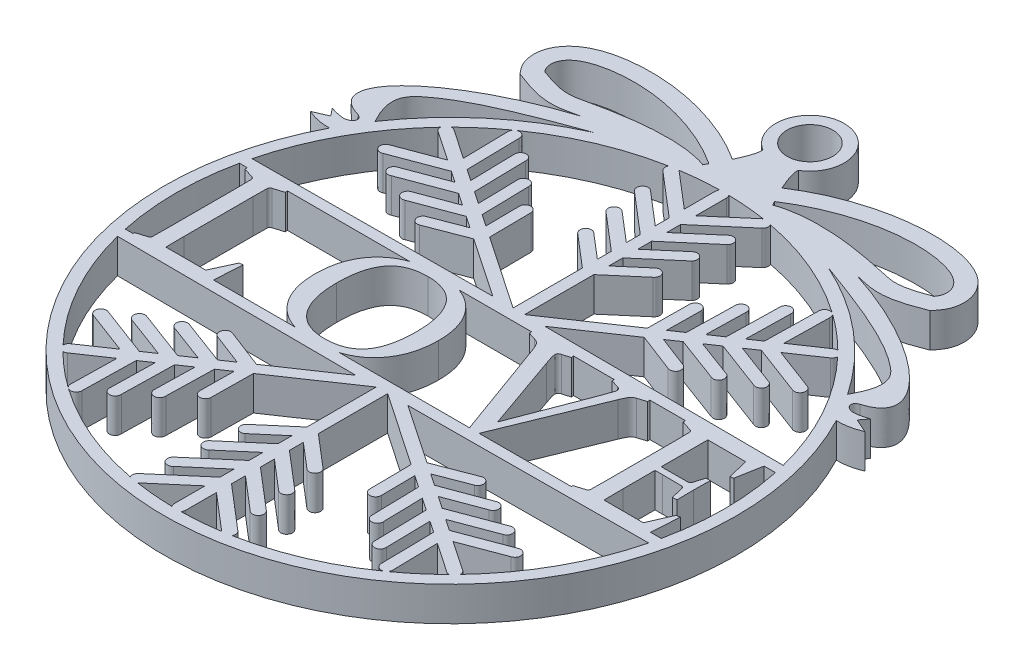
from build123d import *

# Parameters (mm, degrees)
BOSS_EXTRUDE2_DEPTH   = 1.5
BOSS_EXTRUDE2_2_DEPTH = 1.5
SKETCH2_R             = 2
BOSS_EXTRUDE4_DEPTH   = 1.5
SKETCH8_R             = 25.05
SKETCH8_R_2           = 24
EXTRUDE_THIN2_DEPTH   = 3
BOSS_EXTRUDE5_DEPTH   = 3


with BuildPart() as part:
    # Sketch3 → Boss-Extrude2 (new, symmetric)
    with BuildSketch(Plane(origin=(0, 0, 0), x_dir=(1, 0, 0), z_dir=(0, 1, 0))):
        with BuildLine():
            Line((-9.95053993, -12.407957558), (-11.02013319, -13.133363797))
            Line((-11.02013319, -13.133363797), (-11.111956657, -17.716070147))
            ThreePointArc((-11.111956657, -17.716070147), (-11.616135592, -18.254960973), (-12.1078934, -17.704711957))
            Line((-12.1078934, -17.704711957), (-12.030021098, -13.818277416))
            Line((-12.030021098, -13.818277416), (-13.023355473, -14.491964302))
            Line((-13.023355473, -14.491964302), (-13.11065071, -19.136355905))
            ThreePointArc((-13.11065071, -19.136355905), (-13.616817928, -19.663735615), (-14.10818269, -19.122537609))
            Line((-14.10818269, -19.122537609), (-14.034030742, -15.177411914))
            Line((-14.034030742, -15.177411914), (-16.622720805, -16.933081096))
            ThreePointArc((-16.622720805, -16.933081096), (-17.317176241, -16.799920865), (-17.184016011, -16.105465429))
            Line((-17.184016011, -16.105465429), (-14.595325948, -14.349796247))
            Line((-14.595325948, -14.349796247), (-18.2880658, -12.959405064))
            ThreePointArc((-18.2880658, -12.959405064), (-18.609124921, -12.302704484), (-17.931921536, -12.0275133))
            Line((-17.931921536, -12.0275133), (-13.584650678, -13.664348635))
            Line((-13.584650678, -13.664348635), (-12.591316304, -12.990661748))
            Line((-12.591316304, -12.990661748), (-16.230903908, -11.625436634))
            ThreePointArc((-16.230903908, -11.625436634), (-16.560226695, -10.965022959), (-15.873064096, -10.695936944))
            Line((-15.873064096, -10.695936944), (-11.581428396, -12.30574813))
            Line((-11.581428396, -12.30574813), (-10.511835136, -11.580341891))
            Line((-10.511835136, -11.580341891), (-13.755885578, -10.372158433))
            ThreePointArc((-13.755885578, -10.372158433), (-14.092353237, -9.710538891), (-13.399885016, -9.443258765))
            Line((-13.399885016, -9.443258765), (-9.50151089, -10.895132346))
            Line((-9.50151089, -10.895132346), (-8.474348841, -10.198503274))
            Line((-8.474348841, -10.198503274), (-11.245208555, -9.132044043))
            ThreePointArc((-11.245208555, -9.132044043), (-11.533826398, -8.486529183), (-10.888311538, -8.19791134))
            Line((-10.888311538, -8.19791134), (-7.466442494, -9.514933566))
            Line((-7.466442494, -9.514933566), (-2.283761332, -6))
            Line((-2.283761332, -6), (-23.405560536, -5.888541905))
            Line((-23.405560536, -5.888541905), (-23.611336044, -5))
            Line((-23.611336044, -5), (23.611336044, -5))
            Line((23.611336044, -5), (23.405560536, -5.888541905))
            Line((23.405560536, -5.888541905), (2.283761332, -6))
            Line((2.283761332, -6), (7.466442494, -9.514933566))
            Line((7.466442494, -9.514933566), (10.888311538, -8.19791134))
            ThreePointArc((10.888311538, -8.19791134), (11.533826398, -8.486529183), (11.245208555, -9.132044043))
            Line((11.245208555, -9.132044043), (8.474348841, -10.198503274))
            Line((8.474348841, -10.198503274), (9.50151089, -10.895132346))
            Line((9.50151089, -10.895132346), (13.399885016, -9.443258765))
            ThreePointArc((13.399885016, -9.443258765), (14.092353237, -9.710538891), (13.755885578, -10.372158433))
            Line((13.755885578, -10.372158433), (10.511835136, -11.580341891))
            Line((10.511835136, -11.580341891), (11.581428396, -12.30574813))
            Line((11.581428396, -12.30574813), (15.873064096, -10.695936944))
            ThreePointArc((15.873064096, -10.695936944), (16.560226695, -10.965022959), (16.230903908, -11.625436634))
            Line((16.230903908, -11.625436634), (12.591316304, -12.990661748))
            Line((12.591316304, -12.990661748), (13.584650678, -13.664348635))
            Line((13.584650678, -13.664348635), (17.931921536, -12.0275133))
            ThreePointArc((17.931921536, -12.0275133), (18.609124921, -12.302704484), (18.2880658, -12.959405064))
            Line((18.2880658, -12.959405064), (14.595325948, -14.349796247))
            Line((14.595325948, -14.349796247), (17.184016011, -16.105465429))
            ThreePointArc((17.184016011, -16.105465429), (17.317176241, -16.799920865), (16.622720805, -16.933081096))
            Line((16.622720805, -16.933081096), (14.034030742, -15.177411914))
            Line((14.034030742, -15.177411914), (14.10818269, -19.122537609))
            ThreePointArc((14.10818269, -19.122537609), (13.616817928, -19.663735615), (13.11065071, -19.136355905))
            Line((13.11065071, -19.136355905), (13.023355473, -14.491964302))
            Line((13.023355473, -14.491964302), (12.030021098, -13.818277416))
            Line((12.030021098, -13.818277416), (12.1078934, -17.704711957))
            ThreePointArc((12.1078934, -17.704711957), (11.616135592, -18.254960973), (11.111956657, -17.716070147))
            Line((11.111956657, -17.716070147), (11.02013319, -13.133363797))
            Line((11.02013319, -13.133363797), (9.95053993, -12.407957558))
            Line((9.95053993, -12.407957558), (10.028008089, -15.868820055))
            ThreePointArc((10.028008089, -15.868820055), (9.537772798, -16.426153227), (9.03330914, -15.881665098))
            Line((9.03330914, -15.881665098), (8.940215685, -11.722748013))
            Line((8.940215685, -11.722748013), (7.913053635, -11.026118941))
            Line((7.913053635, -11.026118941), (7.947162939, -13.994929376))
            ThreePointArc((7.947162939, -13.994929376), (7.454190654, -14.501849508), (6.947270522, -14.008877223))
            Line((6.947270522, -14.008877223), (6.905147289, -10.342549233))
            Line((6.905147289, -10.342549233), (0.502167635, -6))
            Line((0.502167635, -6), (0.502167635, -12.0664664))
            Line((0.502167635, -12.0664664), (3.297599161, -14.456985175))
            ThreePointArc((3.297599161, -14.456985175), (3.413784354, -15.150742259), (2.722066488, -15.278508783))
            Line((2.722066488, -15.278508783), (0.502167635, -13.380157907))
            Line((0.502167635, -13.380157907), (0.502167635, -14.602209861))
            Line((0.502167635, -14.602209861), (3.764126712, -17.39168059))
            ThreePointArc((3.764126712, -17.39168059), (3.749772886, -18.095076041), (3.046236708, -18.092240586))
            Line((3.046236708, -18.092240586), (0.502167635, -15.916674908))
            Line((0.502167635, -15.916674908), (0.502167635, -17.138726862))
            Line((0.502167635, -17.138726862), (4.053708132, -20.175833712))
            ThreePointArc((4.053708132, -20.175833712), (4.084623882, -20.90950726), (3.350619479, -20.88782325))
            Line((3.350619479, -20.88782325), (0.502167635, -18.451964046))
            Line((0.502167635, -18.451964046), (0.502167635, -19.674016))
            Line((0.502167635, -19.674016), (4.347506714, -22.962365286))
            ThreePointArc((4.347506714, -22.962365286), (4.402725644, -23.669585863), (3.695505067, -23.724804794))
            Line((3.695505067, -23.724804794), (0.502167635, -20.994016))
            Line((0.502167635, -20.994016), (0.502167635, -23.688425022))
            ThreePointArc((0.502167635, -23.688425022), (0, -24.190592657), (-0.502167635, -23.688425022))
            Line((-0.502167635, -23.688425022), (-0.502167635, -20.994016))
            Line((-0.502167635, -20.994016), (-3.695505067, -23.724804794))
            ThreePointArc((-3.695505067, -23.724804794), (-4.402725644, -23.669585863), (-4.347506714, -22.962365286))
            Line((-4.347506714, -22.962365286), (-0.502167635, -19.674016))
            Line((-0.502167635, -19.674016), (-0.502167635, -18.451964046))
            Line((-0.502167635, -18.451964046), (-3.350619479, -20.88782325))
            ThreePointArc((-3.350619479, -20.88782325), (-4.084623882, -20.90950726), (-4.053708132, -20.175833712))
            Line((-4.053708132, -20.175833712), (-0.502167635, -17.138726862))
            Line((-0.502167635, -17.138726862), (-0.502167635, -15.916674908))
            Line((-0.502167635, -15.916674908), (-3.046236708, -18.092240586))
            ThreePointArc((-3.046236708, -18.092240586), (-3.749772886, -18.095076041), (-3.764126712, -17.39168059))
            Line((-3.764126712, -17.39168059), (-0.502167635, -14.602209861))
            Line((-0.502167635, -14.602209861), (-0.502167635, -13.380157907))
            Line((-0.502167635, -13.380157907), (-2.722066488, -15.278508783))
            ThreePointArc((-2.722066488, -15.278508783), (-3.413784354, -15.150742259), (-3.297599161, -14.456985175))
            Line((-3.297599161, -14.456985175), (-0.502167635, -12.0664664))
            Line((-0.502167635, -12.0664664), (-0.502167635, -6))
            Line((-0.502167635, -6), (-6.905147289, -10.342549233))
            Line((-6.905147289, -10.342549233), (-6.947270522, -14.008877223))
            ThreePointArc((-6.947270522, -14.008877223), (-7.454190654, -14.501849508), (-7.947162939, -13.994929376))
            Line((-7.947162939, -13.994929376), (-7.913053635, -11.026118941))
            Line((-7.913053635, -11.026118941), (-8.940215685, -11.722748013))
            Line((-8.940215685, -11.722748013), (-9.03330914, -15.881665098))
            ThreePointArc((-9.03330914, -15.881665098), (-9.537772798, -16.426153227), (-10.028008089, -15.868820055))
            Line((-10.028008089, -15.868820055), (-9.95053993, -12.407957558))
        make_face()
    extrude(amount=BOSS_EXTRUDE2_DEPTH, both=True)



with BuildPart() as body_2:
    # Sketch3 → Boss-Extrude2 2 (new, symmetric)
    with BuildSketch(Plane(origin=(0, 0, 0), x_dir=(1, 0, 0), z_dir=(0, 1, 0))):
        with BuildLine():
            Line((9.95053993, 12.407957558), (11.02013319, 13.133363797))
            Line((11.02013319, 13.133363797), (11.111956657, 17.716070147))
            ThreePointArc((11.111956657, 17.716070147), (11.616135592, 18.254960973), (12.1078934, 17.704711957))
            Line((12.1078934, 17.704711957), (12.030021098, 13.818277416))
            Line((12.030021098, 13.818277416), (13.023355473, 14.491964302))
            Line((13.023355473, 14.491964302), (13.11065071, 19.136355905))
            ThreePointArc((13.11065071, 19.136355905), (13.616817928, 19.663735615), (14.10818269, 19.122537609))
            Line((14.10818269, 19.122537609), (14.034030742, 15.177411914))
            Line((14.034030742, 15.177411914), (16.622720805, 16.933081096))
            ThreePointArc((16.622720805, 16.933081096), (17.317176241, 16.799920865), (17.184016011, 16.105465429))
            Line((17.184016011, 16.105465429), (14.595325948, 14.349796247))
            Line((14.595325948, 14.349796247), (18.2880658, 12.959405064))
            ThreePointArc((18.2880658, 12.959405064), (18.609124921, 12.302704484), (17.931921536, 12.0275133))
            Line((17.931921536, 12.0275133), (13.584650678, 13.664348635))
            Line((13.584650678, 13.664348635), (12.591316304, 12.990661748))
            Line((12.591316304, 12.990661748), (16.230903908, 11.625436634))
            ThreePointArc((16.230903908, 11.625436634), (16.560226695, 10.965022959), (15.873064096, 10.695936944))
            Line((15.873064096, 10.695936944), (11.581428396, 12.30574813))
            Line((11.581428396, 12.30574813), (10.511835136, 11.580341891))
            Line((10.511835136, 11.580341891), (13.755885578, 10.372158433))
            ThreePointArc((13.755885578, 10.372158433), (14.092353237, 9.710538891), (13.399885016, 9.443258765))
            Line((13.399885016, 9.443258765), (9.50151089, 10.895132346))
            Line((9.50151089, 10.895132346), (8.474348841, 10.198503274))
            Line((8.474348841, 10.198503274), (11.245208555, 9.132044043))
            ThreePointArc((11.245208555, 9.132044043), (11.533826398, 8.486529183), (10.888311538, 8.19791134))
            Line((10.888311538, 8.19791134), (7.466442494, 9.514933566))
            Line((7.466442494, 9.514933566), (2.283761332, 6))
            Line((2.283761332, 6), (23.405560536, 5.888541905))
            Line((23.405560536, 5.888541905), (23.611336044, 5))
            Line((23.611336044, 5), (-23.611336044, 5))
            Line((-23.611336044, 5), (-23.405560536, 5.888541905))
            Line((-23.405560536, 5.888541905), (-2.283761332, 6))
            Line((-2.283761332, 6), (-7.466442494, 9.514933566))
            Line((-7.466442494, 9.514933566), (-10.888311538, 8.19791134))
            ThreePointArc((-10.888311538, 8.19791134), (-11.533826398, 8.486529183), (-11.245208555, 9.132044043))
            Line((-11.245208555, 9.132044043), (-8.474348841, 10.198503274))
            Line((-8.474348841, 10.198503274), (-9.50151089, 10.895132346))
            Line((-9.50151089, 10.895132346), (-13.399885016, 9.443258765))
            ThreePointArc((-13.399885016, 9.443258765), (-14.092353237, 9.710538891), (-13.755885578, 10.372158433))
            Line((-13.755885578, 10.372158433), (-10.511835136, 11.580341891))
            Line((-10.511835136, 11.580341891), (-11.581428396, 12.30574813))
            Line((-11.581428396, 12.30574813), (-15.873064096, 10.695936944))
            ThreePointArc((-15.873064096, 10.695936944), (-16.560226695, 10.965022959), (-16.230903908, 11.625436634))
            Line((-16.230903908, 11.625436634), (-12.591316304, 12.990661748))
            Line((-12.591316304, 12.990661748), (-13.584650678, 13.664348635))
            Line((-13.584650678, 13.664348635), (-17.931921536, 12.0275133))
            ThreePointArc((-17.931921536, 12.0275133), (-18.609124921, 12.302704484), (-18.2880658, 12.959405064))
            Line((-18.2880658, 12.959405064), (-14.595325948, 14.349796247))
            Line((-14.595325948, 14.349796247), (-17.184016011, 16.105465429))
            ThreePointArc((-17.184016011, 16.105465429), (-17.317176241, 16.799920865), (-16.622720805, 16.933081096))
            Line((-16.622720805, 16.933081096), (-14.034030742, 15.177411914))
            Line((-14.034030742, 15.177411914), (-14.10818269, 19.122537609))
            ThreePointArc((-14.10818269, 19.122537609), (-13.616817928, 19.663735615), (-13.11065071, 19.136355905))
            Line((-13.11065071, 19.136355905), (-13.023355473, 14.491964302))
            Line((-13.023355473, 14.491964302), (-12.030021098, 13.818277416))
            Line((-12.030021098, 13.818277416), (-12.1078934, 17.704711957))
            ThreePointArc((-12.1078934, 17.704711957), (-11.616135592, 18.254960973), (-11.111956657, 17.716070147))
            Line((-11.111956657, 17.716070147), (-11.02013319, 13.133363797))
            Line((-11.02013319, 13.133363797), (-9.95053993, 12.407957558))
            Line((-9.95053993, 12.407957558), (-10.028008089, 15.868820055))
            ThreePointArc((-10.028008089, 15.868820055), (-9.537772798, 16.426153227), (-9.03330914, 15.881665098))
            Line((-9.03330914, 15.881665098), (-8.940215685, 11.722748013))
            Line((-8.940215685, 11.722748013), (-7.913053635, 11.026118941))
            Line((-7.913053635, 11.026118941), (-7.947162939, 13.994929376))
            ThreePointArc((-7.947162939, 13.994929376), (-7.454190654, 14.501849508), (-6.947270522, 14.008877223))
            Line((-6.947270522, 14.008877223), (-6.905147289, 10.342549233))
            Line((-6.905147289, 10.342549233), (-0.502167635, 6))
            Line((-0.502167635, 6), (-0.502167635, 12.0664664))
            Line((-0.502167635, 12.0664664), (-3.297599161, 14.456985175))
            ThreePointArc((-3.297599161, 14.456985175), (-3.413784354, 15.150742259), (-2.722066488, 15.278508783))
            Line((-2.722066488, 15.278508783), (-0.502167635, 13.380157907))
            Line((-0.502167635, 13.380157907), (-0.502167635, 14.602209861))
            Line((-0.502167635, 14.602209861), (-3.764126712, 17.39168059))
            ThreePointArc((-3.764126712, 17.39168059), (-3.749772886, 18.095076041), (-3.046236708, 18.092240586))
            Line((-3.046236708, 18.092240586), (-0.502167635, 15.916674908))
            Line((-0.502167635, 15.916674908), (-0.502167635, 17.138726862))
            Line((-0.502167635, 17.138726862), (-4.053708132, 20.175833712))
            ThreePointArc((-4.053708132, 20.175833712), (-4.084623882, 20.90950726), (-3.350619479, 20.88782325))
            Line((-3.350619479, 20.88782325), (-0.502167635, 18.451964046))
            Line((-0.502167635, 18.451964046), (-0.502167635, 19.674016))
            Line((-0.502167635, 19.674016), (-4.347506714, 22.962365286))
            ThreePointArc((-4.347506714, 22.962365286), (-4.402725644, 23.669585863), (-3.695505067, 23.724804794))
            Line((-3.695505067, 23.724804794), (-0.502167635, 20.994016))
            Line((-0.502167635, 20.994016), (-0.502167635, 23.688425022))
            ThreePointArc((-0.502167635, 23.688425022), (0, 24.190592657), (0.502167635, 23.688425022))
            Line((0.502167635, 23.688425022), (0.502167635, 20.994016))
            Line((0.502167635, 20.994016), (3.695505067, 23.724804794))
            ThreePointArc((3.695505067, 23.724804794), (4.402725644, 23.669585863), (4.347506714, 22.962365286))
            Line((4.347506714, 22.962365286), (0.502167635, 19.674016))
            Line((0.502167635, 19.674016), (0.502167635, 18.451964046))
            Line((0.502167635, 18.451964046), (3.350619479, 20.88782325))
            ThreePointArc((3.350619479, 20.88782325), (4.084623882, 20.90950726), (4.053708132, 20.175833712))
            Line((4.053708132, 20.175833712), (0.502167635, 17.138726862))
            Line((0.502167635, 17.138726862), (0.502167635, 15.916674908))
            Line((0.502167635, 15.916674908), (3.046236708, 18.092240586))
            ThreePointArc((3.046236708, 18.092240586), (3.749772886, 18.095076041), (3.764126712, 17.39168059))
            Line((3.764126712, 17.39168059), (0.502167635, 14.602209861))
            Line((0.502167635, 14.602209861), (0.502167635, 13.380157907))
            Line((0.502167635, 13.380157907), (2.722066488, 15.278508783))
            ThreePointArc((2.722066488, 15.278508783), (3.413784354, 15.150742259), (3.297599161, 14.456985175))
            Line((3.297599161, 14.456985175), (0.502167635, 12.0664664))
            Line((0.502167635, 12.0664664), (0.502167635, 6))
            Line((0.502167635, 6), (6.905147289, 10.342549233))
            Line((6.905147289, 10.342549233), (6.947270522, 14.008877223))
            ThreePointArc((6.947270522, 14.008877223), (7.454190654, 14.501849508), (7.947162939, 13.994929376))
            Line((7.947162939, 13.994929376), (7.913053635, 11.026118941))
            Line((7.913053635, 11.026118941), (8.940215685, 11.722748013))
            Line((8.940215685, 11.722748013), (9.03330914, 15.881665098))
            ThreePointArc((9.03330914, 15.881665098), (9.537772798, 16.426153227), (10.028008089, 15.868820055))
            Line((10.028008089, 15.868820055), (9.95053993, 12.407957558))
        make_face()
    extrude(amount=BOSS_EXTRUDE2_2_DEPTH, both=True)


with BuildPart() as body_3:
    # Sketch2 → Boss-Extrude4 (new, symmetric)
    # profile 1 of 6: a face of its own
    with BuildSketch(Plane(origin=(0, 0, 0), x_dir=(1, 0, 0), z_dir=(0, 1, 0))):
        with BuildLine():
            add(Edge.make_bspline(
                [(-21.984852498, 13.889314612), (-21.425451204, 13.659442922), (-21.566848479, 13.143977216), (-22.3704381, 12.915956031), (-23.179701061, 13.088289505), (-23.581579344, 13.242077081)],
                knots=[0, 0, 0, 0, 0.635839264, 0.735839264, 1, 1, 1, 1], degree=3))
            Line((-23.581579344, 13.242077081), (-23.055113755, 12.570307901))
            Line((-23.055113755, 12.570307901), (-24.299399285, 12.027768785))
            add(Edge.make_bspline(
                [(-24.299399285, 12.027768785), (-23.200622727, 11.560958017), (-22.137413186, 11.616149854)],
                knots=[0, 0, 0, 0.622250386, 0.622250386, 0.622250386], degree=2))
            ThreePointArc((-22.137413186, 11.616149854), (-21.441447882, 12.855516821), (-20.676170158, 14.053326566))
            add(Edge.make_bspline(
                [(-20.676170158, 14.053326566), (-22.103620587, 16.601719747), (-19.889079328, 18.949917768), (-15.663458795, 20.9429823), (-9.487582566, 23.129759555)],
                knots=[0, 0, 0, 0, 0.333758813, 0.923979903, 0.923979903, 0.923979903, 0.923979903], degree=3))
            ThreePointArc((-9.487582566, 23.129759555), (-8.217191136, 23.610967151), (-6.922536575, 24.022457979))
            ThreePointArc((-6.922536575, 24.022457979), (-6.545923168, 24.127803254), (-6.167707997, 24.227244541))
            add(Edge.make_bspline(
                [(-12.107829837, 23.514528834), (-12.061764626, 23.524623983), (-11.903850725, 23.558997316), (-11.53239248, 23.637404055), (-10.918051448, 23.758275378), (-9.706802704, 23.97135513), (-8.210921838, 24.169455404), (-6.874820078, 24.233329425), (-6.328875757, 24.230827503), (-6.167707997, 24.227244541)],
                knots=[0.41766523, 0.41766523, 0.41766523, 0.41766523, 0.432883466, 0.468899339, 0.529773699, 0.590648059, 0.712396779, 0.773271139, 0.799157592, 0.799157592, 0.799157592, 0.799157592], degree=3))
            add(Edge.make_bspline(
                [(-12.107829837, 23.514528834), (-20.997302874, 20.660636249), (-26.583122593, 15.195786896), (-21.984852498, 13.889314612)],
                knots=[0.159398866, 0.159398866, 0.159398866, 0.159398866, 0.84892325, 0.84892325, 0.84892325, 0.84892325], degree=3))
        make_face()
    # profile 2 of 6: a face of its own
    with BuildSketch(Plane(origin=(0, 0, 0), x_dir=(1, 0, 0), z_dir=(0, 1, 0))):
        with BuildLine():
            add(Edge.make_bspline(
                [(-17.95998301, 24.058120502), (-17.545226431, 23.896825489), (-16.66217893, 23.559491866), (-15.607966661, 23.276253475), (-14.678757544, 23.142281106), (-13.862985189, 23.157329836), (-13.198586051, 23.269826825), (-12.728462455, 23.376064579), (-12.363448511, 23.458189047), (-12.153897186, 23.504433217), (-12.107829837, 23.514528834)],
                knots=[-0.01809554, -0.01809554, -0.01809554, -0.01809554, 0.04277882, 0.10365318, 0.16452754, 0.2254019, 0.286276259, 0.347150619, 0.402446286, 0.41766523, 0.41766523, 0.41766523, 0.41766523], degree=3))
            add(Edge.make_bspline(
                [(-12.107829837, 23.514528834), (-12.061764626, 23.524623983), (-11.903850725, 23.558997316), (-11.53239248, 23.637404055), (-10.918051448, 23.758275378), (-9.706802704, 23.97135513), (-8.210921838, 24.169455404), (-6.874820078, 24.233329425), (-6.328875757, 24.230827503), (-6.167707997, 24.227244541)],
                knots=[0.41766523, 0.41766523, 0.41766523, 0.41766523, 0.432883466, 0.468899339, 0.529773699, 0.590648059, 0.712396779, 0.773271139, 0.799157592, 0.799157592, 0.799157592, 0.799157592], degree=3))
            ThreePointArc((-6.167707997, 24.227244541), (-4.730335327, 24.548399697), (-3.276545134, 24.784354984))
            add(Edge.make_bspline(
                [(-3.060630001, 25.170038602), (-3.164995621, 24.981529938), (-3.276545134, 24.784354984)],
                knots=[0.939410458, 0.939410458, 0.939410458, 1, 1, 1], degree=2))
            add(Edge.make_bspline(
                [(-17.045413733, 25.311888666), (-14.908727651, 24.480955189), (-13.563857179, 24.700771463), (-11.933322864, 25.106934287), (-8.496979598, 25.699913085), (-5.076323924, 25.934029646), (-3.060630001, 25.170038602)],
                knots=[0, 0, 0, 0, 0.312735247, 0.538741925, 0.603057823, 0.955784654, 0.955784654, 0.955784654, 0.955784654], degree=3))
            add(Edge.make_bspline(
                [(-2.868830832, 25.520361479), (-5.090317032, 26.98297168), (-8.419668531, 28.210590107), (-13.617904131, 28.584562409), (-17.30380123, 27.824356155), (-17.518909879, 25.895935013), (-17.045413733, 25.311888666)],
                knots=[0.352532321, 0.352532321, 0.352532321, 0.352532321, 0.605497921, 0.656456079, 0.861874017, 1, 1, 1, 1], degree=3))
            add(Edge.make_bspline(
                [(-2.175350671, 26.883638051), (-2.458536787, 26.278668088), (-2.868830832, 25.520361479)],
                knots=[0.626992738, 0.626992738, 0.626992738, 0.881854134, 0.881854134, 0.881854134], degree=2))
            add(Edge.make_bspline(
                [(-2.175350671, 26.883638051), (-3.78227162, 27.932647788), (-6.490023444, 29.123422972), (-10.258308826, 29.892795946), (-13.083981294, 30.012960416), (-15.266844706, 29.704628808), (-16.794891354, 29.143140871), (-17.841151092, 28.481409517), (-18.64871698, 27.440297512), (-18.907397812, 26.361786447), (-18.791623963, 25.464519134), (-18.56058602, 24.837548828), (-18.190891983, 24.338116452), (-18.072193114, 24.19749399), (-17.995981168, 24.102523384), (-17.95998301, 24.058120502)],
                knots=[0.354465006, 0.354465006, 0.354465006, 0.354465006, 0.520311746, 0.604321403, 0.688331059, 0.772340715, 0.814345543, 0.856350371, 0.898355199, 0.940360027, 0.961362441, 0.982364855, 1.003367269, 1.013868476, 1.024369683, 1.024369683, 1.024369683, 1.024369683], degree=3))
        make_face()
    # profile 3 of 6: a face of its own
    with BuildSketch(Plane(origin=(0, 0, 0), x_dir=(1, 0, 0), z_dir=(0, 1, 0))):
        with BuildLine():
            add(Edge.make_bspline(
                [(-1.551289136, 28.932218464), (-1.478675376, 28.371944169), (-2.175350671, 26.883638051)],
                knots=[0, 0, 0, 0.626992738, 0.626992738, 0.626992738], degree=2))
            add(Edge.make_bspline(
                [(-2.175350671, 26.883638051), (-2.458536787, 26.278668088), (-2.868830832, 25.520361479)],
                knots=[0.626992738, 0.626992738, 0.626992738, 0.881854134, 0.881854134, 0.881854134], degree=2))
            add(Edge.make_bspline(
                [(-2.868830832, 25.520361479), (-2.961489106, 25.349110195), (-3.060630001, 25.170038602)],
                knots=[0.881854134, 0.881854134, 0.881854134, 0.939410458, 0.939410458, 0.939410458], degree=2))
            add(Edge.make_bspline(
                [(-3.060630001, 25.170038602), (-3.164995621, 24.981529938), (-3.276545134, 24.784354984)],
                knots=[0.939410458, 0.939410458, 0.939410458, 1, 1, 1], degree=2))
            ThreePointArc((-3.276545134, 24.784354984), (0, 25), (3.276545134, 24.784354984))
            add(Edge.make_bspline(
                [(3.060630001, 25.170038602), (3.164995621, 24.981529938), (3.276545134, 24.784354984)],
                knots=[0.939410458, 0.939410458, 0.939410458, 1, 1, 1], degree=2))
            add(Edge.make_bspline(
                [(2.868830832, 25.520361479), (2.961489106, 25.349110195), (3.060630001, 25.170038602)],
                knots=[0.881854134, 0.881854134, 0.881854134, 0.939410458, 0.939410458, 0.939410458], degree=2))
            add(Edge.make_bspline(
                [(2.175350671, 26.883638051), (2.458536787, 26.278668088), (2.868830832, 25.520361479)],
                knots=[0.626992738, 0.626992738, 0.626992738, 0.881854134, 0.881854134, 0.881854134], degree=2))
            add(Edge.make_bspline(
                [(1.551289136, 28.932218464), (1.478675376, 28.371944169), (2.175350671, 26.883638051)],
                knots=[0, 0, 0, 0.626992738, 0.626992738, 0.626992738], degree=2))
            ThreePointArc((1.551289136, 28.932218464), (0, 28.5), (-1.551289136, 28.932218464))
        make_face()
    # profile 4 of 6: a face of its own
    with BuildSketch(Plane(origin=(0, 0, 0), x_dir=(1, 0, 0), z_dir=(0, 1, 0))):
        with BuildLine():
            ThreePointArc((20.676170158, 14.053326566), (21.441447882, 12.855516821), (22.137413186, 11.616149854))
            add(Edge.make_bspline(
                [(24.299399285, 12.027768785), (23.200622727, 11.560958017), (22.137413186, 11.616149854)],
                knots=[0, 0, 0, 0.622250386, 0.622250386, 0.622250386], degree=2))
            Line((24.299399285, 12.027768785), (23.055113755, 12.570307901))
            Line((23.055113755, 12.570307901), (23.581579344, 13.242077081))
            add(Edge.make_bspline(
                [(21.984852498, 13.889314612), (21.425451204, 13.659442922), (21.566848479, 13.143977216), (22.3704381, 12.915956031), (23.179701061, 13.088289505), (23.581579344, 13.242077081)],
                knots=[0, 0, 0, 0, 0.635839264, 0.735839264, 1, 1, 1, 1], degree=3))
            add(Edge.make_bspline(
                [(12.107829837, 23.514528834), (20.997302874, 20.660636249), (26.583122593, 15.195786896), (21.984852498, 13.889314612)],
                knots=[0.159398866, 0.159398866, 0.159398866, 0.159398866, 0.84892325, 0.84892325, 0.84892325, 0.84892325], degree=3))
            add(Edge.make_bspline(
                [(12.107829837, 23.514528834), (12.061764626, 23.524623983), (11.903850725, 23.558997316), (11.53239248, 23.637404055), (10.918051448, 23.758275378), (9.706802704, 23.97135513), (8.210921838, 24.169455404), (6.874820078, 24.233329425), (6.328875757, 24.230827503), (6.167707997, 24.227244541)],
                knots=[0.41766523, 0.41766523, 0.41766523, 0.41766523, 0.432883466, 0.468899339, 0.529773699, 0.590648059, 0.712396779, 0.773271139, 0.799157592, 0.799157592, 0.799157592, 0.799157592], degree=3))
            ThreePointArc((6.167707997, 24.227244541), (6.545923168, 24.127803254), (6.922536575, 24.022457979))
            ThreePointArc((6.922536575, 24.022457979), (8.217191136, 23.610967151), (9.487582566, 23.129759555))
            add(Edge.make_bspline(
                [(20.676170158, 14.053326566), (22.103620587, 16.601719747), (19.889079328, 18.949917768), (15.663458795, 20.9429823), (9.487582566, 23.129759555)],
                knots=[0, 0, 0, 0, 0.333758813, 0.923979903, 0.923979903, 0.923979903, 0.923979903], degree=3))
        make_face()
    # profile 5 of 6: a face of its own
    with BuildSketch(Plane(origin=(0, 0, 0), x_dir=(1, 0, 0), z_dir=(0, 1, 0))):
        with BuildLine():
            ThreePointArc((3, 31.5), (-1.474132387, 34.112840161), (-1.551289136, 28.932218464))
            ThreePointArc((-1.551289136, 28.932218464), (0, 28.5), (1.551289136, 28.932218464))
            ThreePointArc((1.551289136, 28.932218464), (2.612840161, 30.025867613), (3, 31.5))
        make_face()
        with Locations(Location((0, 31.5, 0), (0, 0, 270))):
            Circle(SKETCH2_R, mode=Mode.SUBTRACT)
    # profile 6 of 6: a face of its own
    with BuildSketch(Plane(origin=(0, 0, 0), x_dir=(1, 0, 0), z_dir=(0, 1, 0))):
        with BuildLine():
            add(Edge.make_bspline(
                [(3.060630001, 25.170038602), (3.164995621, 24.981529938), (3.276545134, 24.784354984)],
                knots=[0.939410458, 0.939410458, 0.939410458, 1, 1, 1], degree=2))
            ThreePointArc((3.276545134, 24.784354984), (4.730335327, 24.548399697), (6.167707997, 24.227244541))
            add(Edge.make_bspline(
                [(12.107829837, 23.514528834), (12.061764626, 23.524623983), (11.903850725, 23.558997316), (11.53239248, 23.637404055), (10.918051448, 23.758275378), (9.706802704, 23.97135513), (8.210921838, 24.169455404), (6.874820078, 24.233329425), (6.328875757, 24.230827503), (6.167707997, 24.227244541)],
                knots=[0.41766523, 0.41766523, 0.41766523, 0.41766523, 0.432883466, 0.468899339, 0.529773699, 0.590648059, 0.712396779, 0.773271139, 0.799157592, 0.799157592, 0.799157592, 0.799157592], degree=3))
            add(Edge.make_bspline(
                [(17.95998301, 24.058120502), (17.545226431, 23.896825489), (16.66217893, 23.559491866), (15.607966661, 23.276253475), (14.678757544, 23.142281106), (13.862985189, 23.157329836), (13.198586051, 23.269826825), (12.728462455, 23.376064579), (12.363448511, 23.458189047), (12.153897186, 23.504433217), (12.107829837, 23.514528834)],
                knots=[-0.01809554, -0.01809554, -0.01809554, -0.01809554, 0.04277882, 0.10365318, 0.16452754, 0.2254019, 0.286276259, 0.347150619, 0.402446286, 0.41766523, 0.41766523, 0.41766523, 0.41766523], degree=3))
            add(Edge.make_bspline(
                [(2.175350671, 26.883638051), (3.78227162, 27.932647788), (6.490023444, 29.123422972), (10.258308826, 29.892795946), (13.083981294, 30.012960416), (15.266844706, 29.704628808), (16.794891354, 29.143140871), (17.841151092, 28.481409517), (18.64871698, 27.440297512), (18.907397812, 26.361786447), (18.791623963, 25.464519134), (18.56058602, 24.837548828), (18.190891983, 24.338116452), (18.072193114, 24.19749399), (17.995981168, 24.102523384), (17.95998301, 24.058120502)],
                knots=[0.354465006, 0.354465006, 0.354465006, 0.354465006, 0.520311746, 0.604321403, 0.688331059, 0.772340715, 0.814345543, 0.856350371, 0.898355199, 0.940360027, 0.961362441, 0.982364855, 1.003367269, 1.013868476, 1.024369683, 1.024369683, 1.024369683, 1.024369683], degree=3))
            add(Edge.make_bspline(
                [(2.175350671, 26.883638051), (2.458536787, 26.278668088), (2.868830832, 25.520361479)],
                knots=[0.626992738, 0.626992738, 0.626992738, 0.881854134, 0.881854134, 0.881854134], degree=2))
            add(Edge.make_bspline(
                [(2.868830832, 25.520361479), (5.090317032, 26.98297168), (8.419668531, 28.210590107), (13.617904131, 28.584562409), (17.30380123, 27.824356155), (17.518909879, 25.895935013), (17.045413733, 25.311888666)],
                knots=[0.352532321, 0.352532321, 0.352532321, 0.352532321, 0.605497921, 0.656456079, 0.861874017, 1, 1, 1, 1], degree=3))
            add(Edge.make_bspline(
                [(17.045413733, 25.311888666), (14.908727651, 24.480955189), (13.563857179, 24.700771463), (11.933322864, 25.106934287), (8.496979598, 25.699913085), (5.076323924, 25.934029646), (3.060630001, 25.170038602)],
                knots=[0, 0, 0, 0, 0.312735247, 0.538741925, 0.603057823, 0.955784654, 0.955784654, 0.955784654, 0.955784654], degree=3))
        make_face()
    extrude(amount=BOSS_EXTRUDE4_DEPTH, both=True)


with BuildPart() as part_1:
    add(part.part)

    add(body_2.part)  # Extrude-Thin2 merges body 2

    add(body_3.part)  # Extrude-Thin2 merges body 3
    # Sketch8 → Extrude-Thin2 (add)
    with BuildSketch(Plane(origin=(0, 1.5, 0), x_dir=(1, 0, 0), z_dir=(0, 1, 0))):
        Circle(SKETCH8_R)
        Circle(SKETCH8_R_2, mode=Mode.SUBTRACT)
    extrude(amount=-EXTRUDE_THIN2_DEPTH)

    # Sketch10 → Boss-Extrude5 (add)
    # profile 1 of 4: a face of its own
    with BuildSketch(Plane(origin=(0, 1.5, 0), x_dir=(1, 0, 0), z_dir=(0, 1, 0))):
        with BuildLine():
            Line((17.338514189, 5.064), (19.059764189, 5.064))
            add(Edge.make_bspline(
                [(19.059764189, 5.064), (19.331056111, 5.064601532), (19.881434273, 5.065821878), (20.717987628, 5.069681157), (21.57720774, 5.078175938), (22.157309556, 5.087101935), (22.451264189, 5.091625)],
                knots=[0, 0, 0, 0, 0.95986119, 1.947299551, 2.95983638, 4, 4, 4, 4], degree=3))
            Line((22.451264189, 5.091625), (22.495889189, 5.03425))
            Line((22.495889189, 5.03425), (22.079389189, 2.752))
            Line((22.079389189, 2.752), (21.792514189, 2.703125))
            Line((21.792514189, 2.703125), (21.348389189, 4.52))
            Line((21.348389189, 4.52), (18.033389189, 4.52))
            Line((18.033389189, 4.52), (18.033389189, 0.44))
            Line((18.033389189, 0.44), (18.685764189, 0.44))
            add(Edge.make_bspline(
                [(18.685764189, 0.44), (18.813974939, 0.439579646), (19.076779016, 0.438718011), (19.481915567, 0.445558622), (19.908372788, 0.445082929), (20.200185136, 0.450153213), (20.349639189, 0.45275)],
                knots=[0, 0, 0, 0, 0.924608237, 1.895245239, 2.922032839, 4, 4, 4, 4], degree=3))
            add(Edge.make_bspline(
                [(20.349639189, 0.45275), (20.378409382, 0.455176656), (20.433265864, 0.459803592), (20.506321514, 0.495554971), (20.564036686, 0.55176531), (20.583707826, 0.60113407), (20.594014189, 0.627)],
                knots=[0, 0, 0, 0, 1.068716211, 2.037734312, 2.971903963, 4, 4, 4, 4], degree=3))
            Line((20.594014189, 0.627), (20.844764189, 1.528))
            Line((20.844764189, 1.528), (21.233639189, 1.542875))
            add(Edge.make_bspline(
                [(21.233639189, 1.542875), (21.229814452, 1.387755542), (21.222706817, 1.099491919), (21.216921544, 0.699964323), (21.212244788, 0.365633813), (21.210876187, 0.164459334), (21.210264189, 0.0745)],
                knots=[0, 0, 0, 0, 1.267879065, 2.356141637, 3.264914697, 4, 4, 4, 4], degree=3))
            add(Edge.make_bspline(
                [(21.210264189, 0.0745), (21.210879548, -0.013334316), (21.212264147, -0.210967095), (21.216925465, -0.540339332), (21.222714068, -0.935617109), (21.229815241, -1.221047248), (21.233639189, -1.37475)],
                knots=[0, 0, 0, 0, 0.727191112, 1.636226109, 2.727119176, 4, 4, 4, 4], degree=3))
            Line((21.233639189, -1.37475), (20.844764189, -1.402375))
            Line((20.844764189, -1.402375), (20.587639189, -0.331375))
            add(Edge.make_bspline(
                [(20.587639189, -0.331375), (20.57710585, -0.300930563), (20.557598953, -0.244549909), (20.508101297, -0.174971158), (20.441424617, -0.129759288), (20.39067314, -0.122576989), (20.364514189, -0.118875)],
                knots=[0, 0, 0, 0, 1.165841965, 2.159045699, 3.051112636, 4, 4, 4, 4], degree=3))
            add(Edge.make_bspline(
                [(20.364514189, -0.118875), (20.212933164, -0.116537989), (19.916861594, -0.111973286), (19.484051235, -0.108847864), (19.073944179, -0.102894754), (18.80830781, -0.103638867), (18.679389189, -0.104)],
                knots=[0, 0, 0, 0, 1.079495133, 2.108494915, 3.082014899, 4, 4, 4, 4], degree=3))
            Line((18.679389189, -0.104), (18.033389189, -0.104))
            Line((18.033389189, -0.104), (18.033389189, -2.906875))
            add(Edge.make_bspline(
                [(18.033389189, -2.906875), (18.034260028, -3.189504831), (18.035990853, -3.751241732), (18.044190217, -4.312921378), (18.048264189, -4.592)],
                knots=[0, 0, 0, 0, 1.006271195, 2, 2, 2, 2], degree=3))
            Line((18.048264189, -4.592), (21.490764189, -4.592))
            Line((21.490764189, -4.592), (22.366264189, -2.603))
            Line((22.366264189, -2.603), (22.689264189, -2.545625))
            Line((22.689264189, -2.545625), (22.529889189, -5.10625))
            Line((22.529889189, -5.10625), (22.481014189, -5.15725))
            add(Edge.make_bspline(
                [(22.481014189, -5.15725), (22.177137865, -5.154614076), (21.582134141, -5.149452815), (20.707371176, -5.138526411), (19.868678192, -5.138588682), (19.321138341, -5.136850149), (19.053389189, -5.136)],
                knots=[0, 0, 0, 0, 1.063875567, 2.083116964, 3.062636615, 4, 4, 4, 4], degree=3))
            Line((19.053389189, -5.136), (17.368264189, -5.136))
            add(Edge.make_bspline(
                [(17.368264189, -5.136), (17.080680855, -5.136), (16.494889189, -5.136), (15.909097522, -5.136), (15.610889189, -5.136)],
                knots=[0, 0, 0, 0, 0.981862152, 2, 2, 2, 2], degree=3))
            Line((15.610889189, -5.136), (15.583264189, -4.864))
            Line((15.583264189, -4.864), (16.465139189, -4.592))
            add(Edge.make_bspline(
                [(16.465139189, -4.592), (16.492111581, -4.582155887), (16.54332914, -4.563463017), (16.605913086, -4.512754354), (16.647668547, -4.444443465), (16.654775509, -4.392139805), (16.658514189, -4.364625)],
                knots=[0, 0, 0, 0, 1.072356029, 2.036284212, 2.966969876, 4, 4, 4, 4], degree=3))
            add(Edge.make_bspline(
                [(16.658514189, -4.364625), (16.660863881, -4.261211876), (16.665820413, -4.043068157), (16.668921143, -3.697372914), (16.674691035, -3.314890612), (16.67383669, -3.047127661), (16.673389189, -2.906875)],
                knots=[0, 0, 0, 0, 0.851424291, 1.796027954, 2.845572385, 4, 4, 4, 4], degree=3))
            Line((16.673389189, -2.906875), (16.673389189, 3.038875))
            add(Edge.make_bspline(
                [(16.673389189, 3.038875), (16.67384489, 3.157169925), (16.674709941, 3.381727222), (16.66891897, 3.701872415), (16.665837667, 3.989490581), (16.660864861, 4.170795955), (16.658514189, 4.2565)],
                knots=[0, 0, 0, 0, 1.165661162, 2.212755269, 3.155159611, 4, 4, 4, 4], degree=3))
            add(Edge.make_bspline(
                [(16.658514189, 4.2565), (16.656222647, 4.286036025), (16.651902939, 4.341713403), (16.615069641, 4.415397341), (16.560709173, 4.474665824), (16.511592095, 4.494795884), (16.486389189, 4.505125)],
                knots=[0, 0, 0, 0, 1.089053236, 2.052937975, 3.000925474, 4, 4, 4, 4], degree=3))
            Line((16.486389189, 4.505125), (15.598139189, 4.792))
            Line((15.598139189, 4.792), (15.583264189, 5.064))
            add(Edge.make_bspline(
                [(15.583264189, 5.064), (15.883597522, 5.064), (16.468680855, 5.064), (17.053764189, 5.064), (17.338514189, 5.064)],
                knots=[0, 0, 0, 0, 1.026634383, 2, 2, 2, 2], degree=3))
        make_face()
    # profile 2 of 4: a face of its own
    with BuildSketch(Plane(origin=(0, 1.5, 0), x_dir=(1, 0, 0), z_dir=(0, 1, 0))):
        with BuildLine():
            Line((6.744963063, -5.193375), (3.546838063, 3.629625))
            add(Edge.make_bspline(
                [(3.546838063, 3.629625), (3.519092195, 3.704215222), (3.467676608, 3.842437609), (3.388111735, 4.030739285), (3.309537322, 4.181680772), (3.234767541, 4.304201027), (3.14579118, 4.397899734), (3.045103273, 4.47879264), (2.922223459, 4.541540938), (2.832556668, 4.572141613), (2.786088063, 4.588)],
                knots=[0, 0, 0, 0, 1.489553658, 2.760276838, 3.821653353, 4.674739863, 5.434555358, 6.227532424, 7.081442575, 8, 8, 8, 8], degree=3))
            Line((2.786088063, 4.588), (2.133713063, 4.792))
            Line((2.133713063, 4.792), (2.118838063, 5.064))
            add(Edge.make_bspline(
                [(2.118838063, 5.064), (2.24207769, 5.059410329), (2.499131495, 5.049837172), (2.900097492, 5.041823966), (3.331497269, 5.038070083), (3.629004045, 5.036952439), (3.782713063, 5.036375)],
                knots=[0, 0, 0, 0, 0.889237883, 1.854776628, 2.891654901, 4, 4, 4, 4], degree=3))
            add(Edge.make_bspline(
                [(3.782713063, 5.036375), (4.111395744, 5.037330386), (4.778745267, 5.03927018), (5.445896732, 5.055674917), (5.784463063, 5.064)],
                knots=[0, 0, 0, 0, 0.985039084, 2, 2, 2, 2], degree=3))
            Line((5.784463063, 5.064), (5.812088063, 4.792))
            Line((5.812088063, 4.792), (5.138463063, 4.594375))
            add(Edge.make_bspline(
                [(5.138463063, 4.594375), (5.096584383, 4.581749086), (5.021162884, 4.559010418), (4.925667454, 4.496050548), (4.873979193, 4.39790079), (4.869127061, 4.325823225), (4.866463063, 4.28625)],
                knots=[0, 0, 0, 0, 1.162103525, 2.092892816, 2.952928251, 4, 4, 4, 4], degree=3))
            add(Edge.make_bspline(
                [(4.866463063, 4.28625), (4.867306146, 4.259987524), (4.869162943, 4.202147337), (4.885645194, 4.109986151), (4.909342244, 4.005161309), (4.941243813, 3.887212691), (4.985585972, 3.755744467), (5.033426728, 3.606414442), (5.092083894, 3.44062535), (5.13219347, 3.323660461), (5.153338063, 3.262)],
                knots=[0, 0, 0, 0, 0.590230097, 1.29991626, 2.099858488, 3.007946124, 4.045650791, 5.21932079, 6.534107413, 8, 8, 8, 8], degree=3))
            Line((5.153338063, 3.262), (7.469588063, -3.32975))
            Line((7.469588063, -3.32975), (9.987713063, 3.272625))
            add(Edge.make_bspline(
                [(9.987713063, 3.272625), (10.012127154, 3.336253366), (10.058373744, 3.456781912), (10.118990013, 3.629797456), (10.174370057, 3.781782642), (10.222229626, 3.915288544), (10.261247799, 4.032460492), (10.29047336, 4.137061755), (10.305031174, 4.229904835), (10.308937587, 4.287636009), (10.310713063, 4.313875)],
                knots=[0, 0, 0, 0, 1.495012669, 2.831939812, 4.021487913, 5.043784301, 5.943055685, 6.730826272, 7.423156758, 8, 8, 8, 8], degree=3))
            add(Edge.make_bspline(
                [(10.310713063, 4.313875), (10.309098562, 4.35398287), (10.306186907, 4.42631502), (10.243533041, 4.516519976), (10.149216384, 4.572064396), (10.076845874, 4.595958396), (10.036588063, 4.60925)],
                knots=[0, 0, 0, 0, 1.070116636, 1.929891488, 2.848453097, 4, 4, 4, 4], degree=3))
            Line((10.036588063, 4.60925), (9.369338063, 4.792))
            Line((9.369338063, 4.792), (9.356588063, 5.064))
            add(Edge.make_bspline(
                [(9.356588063, 5.064), (9.618649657, 5.055677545), (10.144101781, 5.03899043), (10.669816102, 5.037248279), (10.933338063, 5.036375)],
                knots=[0, 0, 0, 0, 0.997470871, 2, 2, 2, 2], degree=3))
            add(Edge.make_bspline(
                [(10.933338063, 5.036375), (11.193320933, 5.03715846), (11.70275294, 5.038693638), (12.211902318, 5.055681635), (12.461213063, 5.064)],
                knots=[0, 0, 0, 0, 1.020677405, 2, 2, 2, 2], degree=3))
            Line((12.461213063, 5.064), (12.490963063, 4.792))
            Line((12.490963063, 4.792), (11.766338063, 4.55825))
            add(Edge.make_bspline(
                [(11.766338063, 4.55825), (11.726953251, 4.545163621), (11.650238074, 4.519673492), (11.545590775, 4.464647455), (11.456370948, 4.395511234), (11.37963988, 4.308518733), (11.307142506, 4.194323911), (11.226817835, 4.044254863), (11.13704687, 3.851308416), (11.075297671, 3.707720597), (11.041713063, 3.629625)],
                knots=[0, 0, 0, 0, 0.811113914, 1.579917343, 2.300751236, 3.007456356, 3.837762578, 4.941671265, 6.336613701, 8, 8, 8, 8], degree=3))
            Line((11.041713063, 3.629625), (7.463213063, -5.136))
            Line((7.463213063, -5.136), (6.744963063, -5.193375))
        make_face()
    # profile 3 of 4: a face of its own
    with BuildSketch(Plane(origin=(0, 1.5, 0), x_dir=(1, 0, 0), z_dir=(0, 1, 0))):
        with BuildLine():
            add(Edge.make_bspline(
                [(-1.296463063, 0.263625), (-1.299909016, 0.060114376), (-1.306641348, -0.33748283), (-1.377720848, -0.917909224), (-1.485950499, -1.468070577), (-1.64173595, -1.987634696), (-1.841968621, -2.476840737), (-2.086755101, -2.936017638), (-2.378121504, -3.363578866), (-2.71133923, -3.758813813), (-3.08405373, -4.116087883), (-3.495772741, -4.426644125), (-3.941983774, -4.68927069), (-4.4243447, -4.902428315), (-4.94159507, -5.068338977), (-5.494036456, -5.185683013), (-6.081349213, -5.26016062), (-6.484771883, -5.267984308), (-6.691838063, -5.272)],
                knots=[0, 0, 0, 0, 1.11638267, 2.1810686, 3.204206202, 4.190568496, 5.152881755, 6.100740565, 7.040963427, 7.987186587, 8.933050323, 9.868382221, 10.811125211, 11.768305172, 12.756733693, 13.786856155, 14.864051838, 16, 16, 16, 16], degree=3))
            add(Edge.make_bspline(
                [(-6.691838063, -5.272), (-6.888238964, -5.268302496), (-7.270875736, -5.261098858), (-7.827768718, -5.19411851), (-8.350004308, -5.084553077), (-8.838868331, -4.931389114), (-9.293040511, -4.733887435), (-9.713648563, -4.491606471), (-10.100548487, -4.206249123), (-10.449433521, -3.87529239), (-10.759018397, -3.506948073), (-11.03078714, -3.108088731), (-11.259628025, -2.676800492), (-11.44607371, -2.215145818), (-11.591029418, -1.721791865), (-11.694192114, -1.198380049), (-11.756409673, -0.643834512), (-11.764382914, -0.264246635), (-11.768463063, -0.07)],
                knots=[0, 0, 0, 0, 1.143055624, 2.226950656, 3.259804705, 4.245814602, 5.204274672, 6.137262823, 7.065975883, 7.996554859, 8.930089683, 9.862284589, 10.801313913, 11.766977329, 12.756052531, 13.790453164, 14.869307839, 16, 16, 16, 16], degree=3))
            add(Edge.make_bspline(
                [(-11.768463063, -0.07), (-11.763761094, 0.132745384), (-11.754578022, 0.52871263), (-11.689287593, 1.106457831), (-11.575718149, 1.650748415), (-11.422199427, 2.164366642), (-11.218929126, 2.64365186), (-10.974085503, 3.092406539), (-10.680459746, 3.505601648), (-10.346992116, 3.887144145), (-9.973348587, 4.229215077), (-9.562490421, 4.527543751), (-9.11451221, 4.77575256), (-8.634664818, 4.983429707), (-8.119400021, 5.142631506), (-7.570501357, 5.253624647), (-6.987575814, 5.323133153), (-6.58720676, 5.331634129), (-6.381588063, 5.336)],
                knots=[0, 0, 0, 0, 1.125528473, 2.198187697, 3.222407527, 4.208902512, 5.169352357, 6.107450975, 7.041410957, 7.977727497, 8.91575193, 9.847888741, 10.789804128, 11.753340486, 12.745907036, 13.777828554, 14.858752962, 16, 16, 16, 16], degree=3))
            add(Edge.make_bspline(
                [(-6.381588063, 5.336), (-6.184491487, 5.332141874), (-5.800549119, 5.32462628), (-5.242433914, 5.259984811), (-4.718741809, 5.154713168), (-4.229391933, 5.006113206), (-3.773948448, 4.814436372), (-3.352696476, 4.580314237), (-2.967189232, 4.301721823), (-2.618537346, 3.98232227), (-2.307517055, 3.626354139), (-2.036184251, 3.23722796), (-1.805990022, 2.816943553), (-1.618458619, 2.365902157), (-1.473926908, 1.883648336), (-1.370693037, 1.370835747), (-1.308506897, 0.826862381), (-1.300541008, 0.454332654), (-1.296463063, 0.263625)],
                knots=[0, 0, 0, 0, 1.160171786, 2.260004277, 3.3028584, 4.301545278, 5.265924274, 6.206933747, 7.132953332, 8.05987408, 8.985001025, 9.910579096, 10.84755036, 11.801009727, 12.781309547, 13.80698458, 14.877338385, 16, 16, 16, 16], degree=3))
        make_face()
        with BuildLine():
            add(Edge.make_bspline(
                [(-10.136463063, 0.165875), (-10.133882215, -0.020527), (-10.128869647, -0.38256033), (-10.082305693, -0.908900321), (-10.013546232, -1.402441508), (-9.907498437, -1.861402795), (-9.778468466, -2.288735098), (-9.612874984, -2.681087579), (-9.423395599, -3.042491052), (-9.20085659, -3.366950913), (-8.951994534, -3.657308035), (-8.67080815, -3.906183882), (-8.365862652, -4.121787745), (-8.030613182, -4.294226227), (-7.668850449, -4.428675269), (-7.279483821, -4.523389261), (-6.862903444, -4.581848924), (-6.575870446, -4.58855377), (-6.428338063, -4.592)],
                knots=[0, 0, 0, 0, 1.304085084, 2.532817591, 3.695065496, 4.78809196, 5.825982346, 6.814663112, 7.763733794, 8.676636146, 9.562133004, 10.43274368, 11.297677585, 12.168951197, 13.062953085, 13.992246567, 14.968032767, 16, 16, 16, 16], degree=3))
            add(Edge.make_bspline(
                [(-6.428338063, -4.592), (-6.283652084, -4.589181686), (-6.003152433, -4.583717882), (-5.596951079, -4.528886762), (-5.219852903, -4.443518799), (-4.871342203, -4.321983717), (-4.552911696, -4.164252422), (-4.263454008, -3.971705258), (-4.003291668, -3.744461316), (-3.774472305, -3.479725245), (-3.573193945, -3.178303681), (-3.398568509, -2.838269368), (-3.253883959, -2.457740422), (-3.13146936, -2.039620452), (-3.043442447, -1.580302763), (-2.975009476, -1.083212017), (-2.934743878, -0.545953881), (-2.930605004, -0.174901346), (-2.928463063, 0.017125)],
                knots=[0, 0, 0, 0, 1.045787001, 2.027445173, 2.958128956, 3.8378376, 4.690032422, 5.521152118, 6.345169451, 7.180273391, 8.044074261, 8.960481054, 9.93838987, 10.983988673, 12.107130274, 13.316944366, 14.61147056, 16, 16, 16, 16], degree=3))
            add(Edge.make_bspline(
                [(-2.928463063, 0.017125), (-2.931308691, 0.197840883), (-2.936851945, 0.549873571), (-2.979989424, 1.06149859), (-3.048055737, 1.54118008), (-3.148713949, 1.987789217), (-3.27490346, 2.402632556), (-3.429838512, 2.786147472), (-3.615544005, 3.136137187), (-3.828019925, 3.455304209), (-4.070752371, 3.739888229), (-4.345185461, 3.987407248), (-4.652757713, 4.194420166), (-4.98981571, 4.366024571), (-5.359569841, 4.493650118), (-5.756814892, 4.590986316), (-6.186728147, 4.645079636), (-6.483443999, 4.652282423), (-6.636588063, 4.656)],
                knots=[0, 0, 0, 0, 1.279140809, 2.491753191, 3.632051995, 4.706223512, 5.72926142, 6.698601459, 7.629502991, 8.529309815, 9.407680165, 10.270512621, 11.136965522, 12.025001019, 12.940102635, 13.899679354, 14.915960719, 16, 16, 16, 16], degree=3))
            add(Edge.make_bspline(
                [(-6.636588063, 4.656), (-6.784817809, 4.653238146), (-7.070972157, 4.647906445), (-7.484898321, 4.592811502), (-7.867757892, 4.507830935), (-8.22046932, 4.386224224), (-8.54113073, 4.229503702), (-8.829077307, 4.034743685), (-9.089425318, 3.809873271), (-9.312959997, 3.543535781), (-9.510993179, 3.245419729), (-9.677096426, 2.909440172), (-9.819894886, 2.53957396), (-9.935898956, 2.13404105), (-10.026401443, 1.692826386), (-10.091788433, 1.215855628), (-10.129595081, 0.702701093), (-10.134124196, 0.348689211), (-10.136463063, 0.165875)],
                knots=[0, 0, 0, 0, 1.087807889, 2.099989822, 3.060151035, 3.963167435, 4.833090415, 5.67263133, 6.509283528, 7.350401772, 8.217350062, 9.131456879, 10.096353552, 11.125116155, 12.224709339, 13.400840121, 14.657775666, 16, 16, 16, 16], degree=3))
        make_face(mode=Mode.SUBTRACT)
    # profile 4 of 4: a face of its own
    with BuildSketch(Plane(origin=(0, 1.5, 0), x_dir=(1, 0, 0), z_dir=(0, 1, 0))):
        with BuildLine():
            Line((-20.345389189, 3.051625), (-20.345389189, -2.970625))
            add(Edge.make_bspline(
                [(-20.345389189, -2.970625), (-20.344518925, -3.242630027), (-20.342789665, -3.783118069), (-20.334588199, -4.323546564), (-20.330514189, -4.592)],
                knots=[0, 0, 0, 0, 1.006516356, 2, 2, 2, 2], degree=3))
            Line((-20.330514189, -4.592), (-16.837014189, -4.592))
            Line((-16.837014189, -4.592), (-15.919014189, -2.605125))
            Line((-15.919014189, -2.605125), (-15.596014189, -2.552))
            Line((-15.596014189, -2.552), (-15.755389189, -5.108375))
            Line((-15.755389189, -5.108375), (-15.797889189, -5.15725))
            add(Edge.make_bspline(
                [(-15.797889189, -5.15725), (-16.101765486, -5.15461144), (-16.697477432, -5.149438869), (-17.57365727, -5.138527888), (-18.415183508, -5.138586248), (-18.964848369, -5.136850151), (-19.234014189, -5.136)],
                knots=[0, 0, 0, 0, 1.061243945, 2.080437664, 3.060008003, 4, 4, 4, 4], degree=3))
            Line((-19.234014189, -5.136), (-21.010514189, -5.136))
            add(Edge.make_bspline(
                [(-21.010514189, -5.136), (-21.298097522, -5.136), (-21.883889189, -5.136), (-22.469680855, -5.136), (-22.767889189, -5.136)],
                knots=[0, 0, 0, 0, 0.981862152, 2, 2, 2, 2], degree=3))
            Line((-22.767889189, -5.136), (-22.795514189, -4.864))
            Line((-22.795514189, -4.864), (-21.913639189, -4.592))
            add(Edge.make_bspline(
                [(-21.913639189, -4.592), (-21.886666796, -4.582155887), (-21.835449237, -4.563463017), (-21.772865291, -4.512754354), (-21.73110983, -4.444443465), (-21.724002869, -4.392139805), (-21.720264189, -4.364625)],
                knots=[0, 0, 0, 0, 1.072356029, 2.036284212, 2.966969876, 4, 4, 4, 4], degree=3))
            add(Edge.make_bspline(
                [(-21.720264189, -4.364625), (-21.717914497, -4.261211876), (-21.712957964, -4.043068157), (-21.709857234, -3.697372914), (-21.704087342, -3.314890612), (-21.704941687, -3.047127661), (-21.705389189, -2.906875)],
                knots=[0, 0, 0, 0, 0.851424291, 1.796027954, 2.845572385, 4, 4, 4, 4], degree=3))
            Line((-21.705389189, -2.906875), (-21.705389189, 3.038875))
            add(Edge.make_bspline(
                [(-21.705389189, 3.038875), (-21.704933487, 3.157169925), (-21.704068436, 3.381727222), (-21.709859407, 3.701872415), (-21.71294071, 3.989490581), (-21.717913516, 4.170795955), (-21.720264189, 4.2565)],
                knots=[0, 0, 0, 0, 1.165661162, 2.212755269, 3.155159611, 4, 4, 4, 4], degree=3))
            add(Edge.make_bspline(
                [(-21.720264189, 4.2565), (-21.72255573, 4.286036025), (-21.726875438, 4.341713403), (-21.763708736, 4.415397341), (-21.818069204, 4.474665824), (-21.867186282, 4.494795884), (-21.892389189, 4.505125)],
                knots=[0, 0, 0, 0, 1.089053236, 2.052937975, 3.000925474, 4, 4, 4, 4], degree=3))
            Line((-21.892389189, 4.505125), (-22.780639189, 4.792))
            Line((-22.780639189, 4.792), (-22.795514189, 5.064))
            add(Edge.make_bspline(
                [(-22.795514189, 5.064), (-22.495200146, 5.055673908), (-21.910225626, 5.039455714), (-21.325031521, 5.03738342), (-21.040264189, 5.036375)],
                knots=[0, 0, 0, 0, 1.026759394, 2, 2, 2, 2], degree=3))
            add(Edge.make_bspline(
                [(-21.040264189, 5.036375), (-20.754079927, 5.037367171), (-20.168176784, 5.039398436), (-19.58249489, 5.055674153), (-19.282889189, 5.064)],
                knots=[0, 0, 0, 0, 0.976899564, 2, 2, 2, 2], degree=3))
            Line((-19.282889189, 5.064), (-19.255264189, 4.792))
            Line((-19.255264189, 4.792), (-20.143514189, 4.517875))
            add(Edge.make_bspline(
                [(-20.143514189, 4.517875), (-20.169856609, 4.508897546), (-20.219203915, 4.492080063), (-20.280024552, 4.440749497), (-20.319106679, 4.370541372), (-20.326610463, 4.316492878), (-20.330514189, 4.288375)],
                knots=[0, 0, 0, 0, 1.042878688, 1.953626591, 2.935406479, 4, 4, 4, 4], degree=3))
            add(Edge.make_bspline(
                [(-20.330514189, 4.288375), (-20.331071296, 4.240205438), (-20.332300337, 4.133938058), (-20.337936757, 3.95973958), (-20.338992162, 3.755705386), (-20.340620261, 3.538246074), (-20.344446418, 3.337806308), (-20.34162601, 3.186180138), (-20.345555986, 3.097677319), (-20.345419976, 3.060125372), (-20.345389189, 3.051625)],
                knots=[0, 0, 0, 0, 0.934714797, 2.062084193, 3.38161047, 4.893548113, 6.281792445, 7.271383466, 7.835068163, 8, 8, 8, 8], degree=3))
        make_face()
    extrude(amount=-BOSS_EXTRUDE5_DEPTH)


solid = part_1.part
